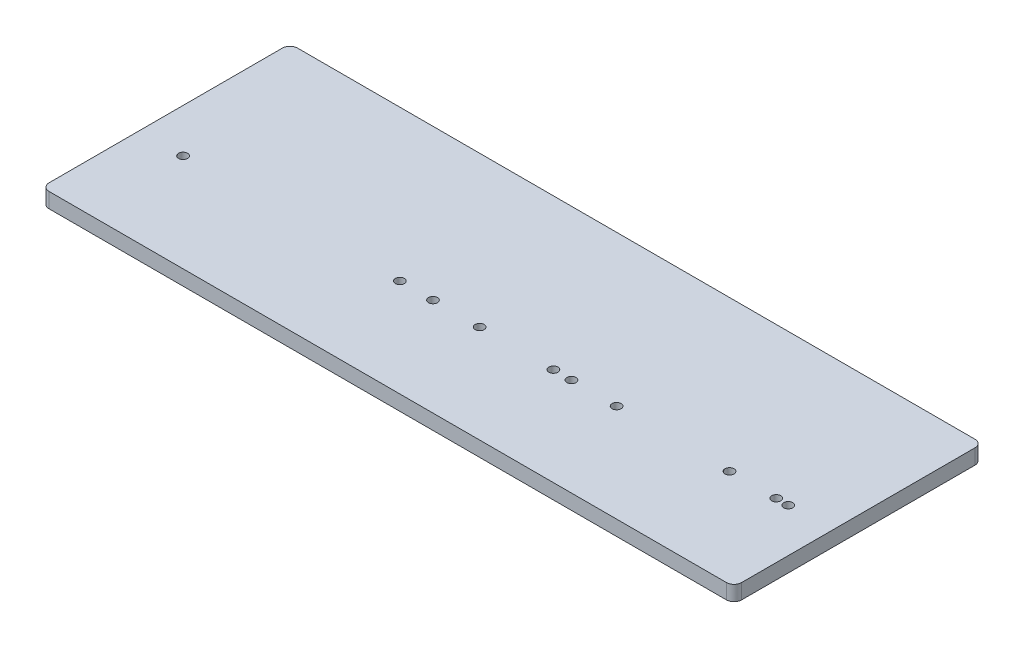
from build123d import *

# Parameters (mm, degrees)
ESQUISSE1_W             = 460
ESQUISSE1_H             = 165
EXTRUSION1_DEPTH        = 10
ESQUISSE2_R             = 3
ENL_V_MAT_EXTRU_1_DEPTH = 420.401234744
CONG_1_R                = 5


with BuildPart() as part:
    # Esquisse1 → Extrusion1 (new body)
    with BuildSketch(Plane(origin=(0, 0, 0), x_dir=(1, 0, 0), z_dir=(0, 1, 0))):
        with Locations((171.171557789, 39.396582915)):
            Rectangle(ESQUISSE1_W, ESQUISSE1_H)
    extrude(amount=EXTRUSION1_DEPTH)

    # Esquisse2 → Enl_v. mat.-Extru.1 (cut, through all)
    with BuildSketch(Plane(origin=(0, 10, 0), x_dir=(-1, 0, 0), z_dir=(0, 1, 0))):
        with Locations(Location((29.828442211, -21.896582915, 0), (0, 0, 90))):
            Circle(ESQUISSE2_R)
        with Locations(Location((-136.171557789, -21.896582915, 0), (0, 0, 90))):
            Circle(ESQUISSE2_R)
        with Locations(Location((-114.171557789, -21.896582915, 0), (0, 0, 90))):
            Circle(ESQUISSE2_R)
        with Locations(Location((-167.171557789, -21.896582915, 0), (0, 0, 90))):
            Circle(ESQUISSE2_R)
        with Locations(Location((-216.171557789, -21.896582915, 0), (0, 0, 90))):
            Circle(ESQUISSE2_R)
        with Locations(Location((-228.171557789, -21.896582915, 0), (0, 0, 90))):
            Circle(ESQUISSE2_R)
        with Locations(Location((-258.171557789, -21.896582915, 0), (0, 0, 90))):
            Circle(ESQUISSE2_R)
        with Locations(Location((-333.171557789, -21.896582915, 0), (0, 0, 90))):
            Circle(ESQUISSE2_R)
        with Locations(Location((-364.171557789, -21.896582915, 0), (0, 0, 90))):
            Circle(ESQUISSE2_R)
        with Locations(Location((-372.171557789, -21.896582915, 0), (0, 0, 90))):
            Circle(ESQUISSE2_R)
    extrude(amount=-ENL_V_MAT_EXTRU_1_DEPTH, mode=Mode.SUBTRACT)

    # Cong_1
    cong_1_edges = [part.edges().sort_by_distance(p)[0] for p in [
        (-58.828442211, 5, -121.896582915),
        (401.171557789, 5, -121.896582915),
        (401.171557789, 5, 43.103417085),
        (-58.828442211, 5, 43.103417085),
    ]]
    fillet(cong_1_edges, radius=CONG_1_R)


solid = part.part
